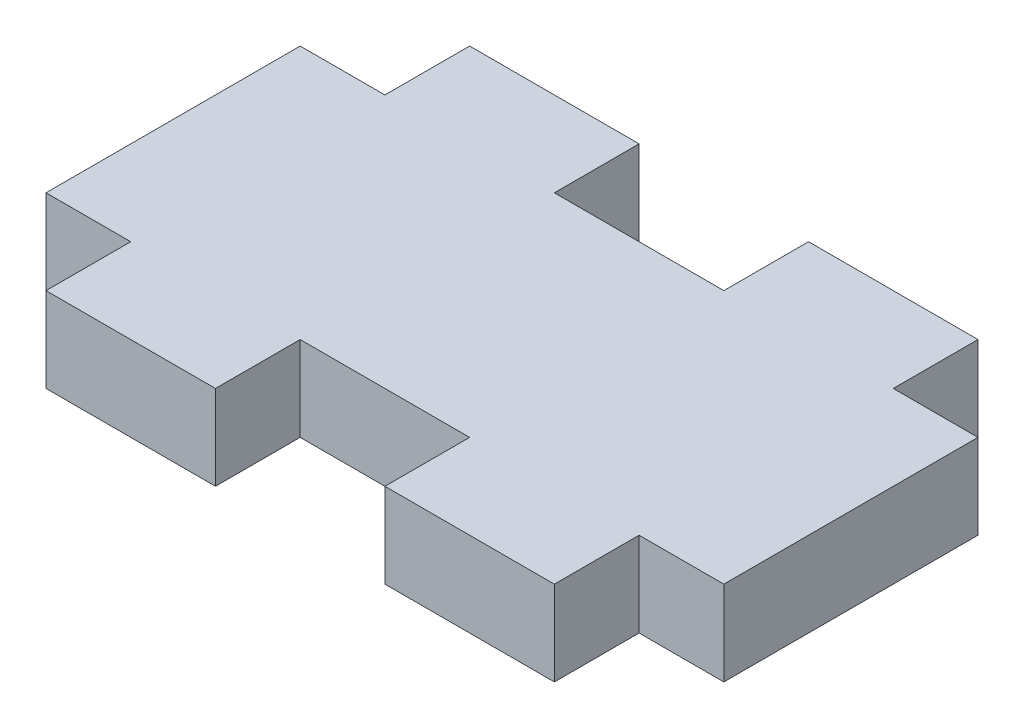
from build123d import *

# Parameters (mm, degrees)
SKETCH1_W           = 50.8
SKETCH1_H           = 19.05
BOSS_EXTRUDE1_DEPTH = 3.175
SKETCH2_W           = 12.7
SKETCH2_H           = 6.35
BOSS_EXTRUDE2_DEPTH = 6.35


with BuildPart() as part:
    # Sketch1 → Boss-Extrude1 (new, symmetric)
    with BuildSketch(Plane(origin=(0, 0, 0), x_dir=(1, 0, 0), z_dir=(0, 1, 0))):
        Rectangle(SKETCH1_W, SKETCH1_H)
    extrude(amount=BOSS_EXTRUDE1_DEPTH, both=True)

    # Sketch2 → Boss-Extrude2 (add)
    with BuildSketch(Plane(origin=(0, 3.175, 0), x_dir=(1, 0, 0), z_dir=(0, 1, 0))):
        with Locations((-12.7, 12.7)):
            Rectangle(SKETCH2_W, SKETCH2_H)
        with Locations((12.7, 12.7)):
            Rectangle(SKETCH2_W, SKETCH2_H)
    boss_extrude2 = extrude(amount=-BOSS_EXTRUDE2_DEPTH)

    # Mirror1: Boss-Extrude2 across plane
    add(boss_extrude2.mirror(Plane.XY))


solid = part.part
